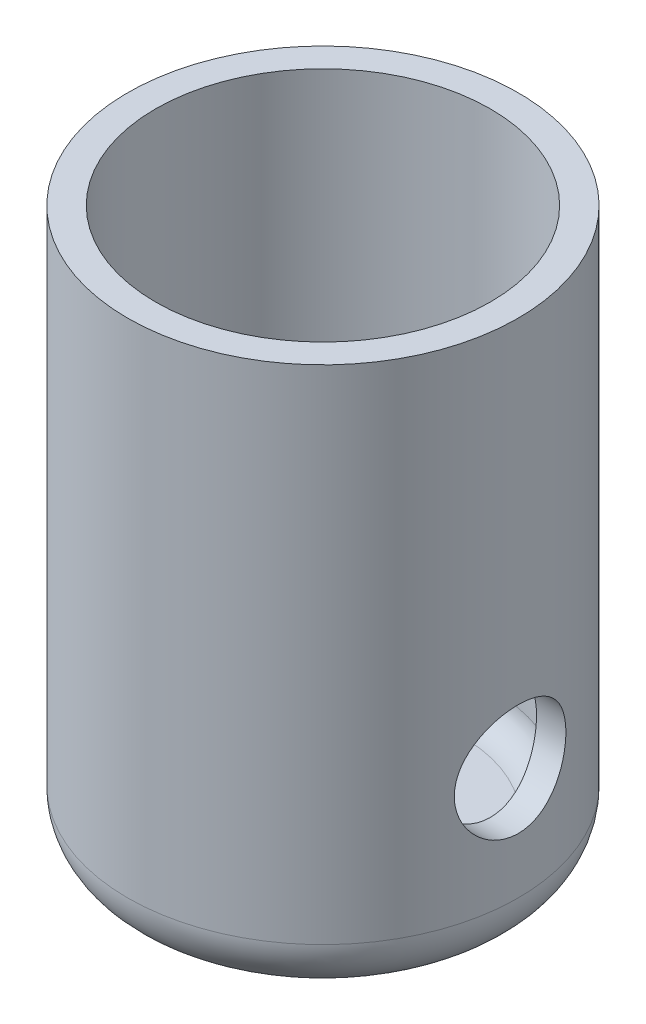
ISO-10303-21;
HEADER;
FILE_DESCRIPTION(('STEP AP214'),'2;1');
FILE_NAME('part.step','',(''),(''),'','','');
FILE_SCHEMA(('AUTOMOTIVE_DESIGN { 1 0 10303 214 1 1 1 1 }'));
ENDSEC;
DATA;
#1=APPLICATION_CONTEXT('core data for automotive mechanical design processes');
#2=APPLICATION_PROTOCOL_DEFINITION('international standard','automotive_design',2000,#1);
#3=PRODUCT_CONTEXT('',#1,'mechanical');
#4=PRODUCT('Part','Part','',(#3));
#5=PRODUCT_RELATED_PRODUCT_CATEGORY('part','',(#4));
#6=PRODUCT_DEFINITION_FORMATION('','',#4);
#7=PRODUCT_DEFINITION_CONTEXT('part definition',#1,'design');
#8=PRODUCT_DEFINITION('design','',#6,#7);
#9=PRODUCT_DEFINITION_SHAPE('','',#8);
#10=(LENGTH_UNIT() NAMED_UNIT(*) SI_UNIT(.MILLI.,.METRE.));
#11=(NAMED_UNIT(*) PLANE_ANGLE_UNIT() SI_UNIT($,.RADIAN.));
#12=(NAMED_UNIT(*) SI_UNIT($,.STERADIAN.) SOLID_ANGLE_UNIT());
#13=UNCERTAINTY_MEASURE_WITH_UNIT(LENGTH_MEASURE(1.E-05),#10,'distance_accuracy_value','');
#14=(GEOMETRIC_REPRESENTATION_CONTEXT(3) GLOBAL_UNCERTAINTY_ASSIGNED_CONTEXT((#13)) GLOBAL_UNIT_ASSIGNED_CONTEXT((#10,
#11,#12)) REPRESENTATION_CONTEXT('',''));
#15=CARTESIAN_POINT('',(0.,0.,0.));
#16=DIRECTION('',(0.,0.,1.));
#17=DIRECTION('',(1.,0.,0.));
#18=AXIS2_PLACEMENT_3D('',#15,#16,#17);
#19=CARTESIAN_POINT('',(3.88902869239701,30.7949839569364,0.));
#20=DIRECTION('',(0.,1.,0.));
#21=DIRECTION('',(0.,0.,1.));
#22=AXIS2_PLACEMENT_3D('',#19,#20,#21);
#23=CYLINDRICAL_SURFACE('',#22,3.5);
#24=CARTESIAN_POINT('',(7.38902869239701,17.2853570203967,0.));
#25=CARTESIAN_POINT('',(7.38902803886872,17.2853560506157,-0.0549774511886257));
#26=CARTESIAN_POINT('',(7.38772077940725,17.2808081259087,-0.109964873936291));
#27=CARTESIAN_POINT('',(7.38263322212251,17.2627748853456,-0.218345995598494));
#28=CARTESIAN_POINT('',(7.37885198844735,17.2492861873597,-0.271739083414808));
#29=CARTESIAN_POINT('',(7.36923214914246,17.2138530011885,-0.375352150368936));
#30=CARTESIAN_POINT('',(7.36339641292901,17.1919203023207,-0.425576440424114));
#31=CARTESIAN_POINT('',(7.35027858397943,17.1402680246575,-0.521634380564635));
#32=CARTESIAN_POINT('',(7.34299633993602,17.1105476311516,-0.567467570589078));
#33=CARTESIAN_POINT('',(7.32755236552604,17.0433395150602,-0.654647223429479));
#34=CARTESIAN_POINT('',(7.31937390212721,17.0056846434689,-0.695861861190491));
#35=CARTESIAN_POINT('',(7.30316236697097,16.924033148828,-0.771485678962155));
#36=CARTESIAN_POINT('',(7.29512931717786,16.8800355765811,-0.805893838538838));
#37=CARTESIAN_POINT('',(7.27994376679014,16.7858602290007,-0.867598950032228));
#38=CARTESIAN_POINT('',(7.27281220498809,16.7355760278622,-0.894739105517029));
#39=CARTESIAN_POINT('',(7.26048541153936,16.6309210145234,-0.940125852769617));
#40=CARTESIAN_POINT('',(7.25528976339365,16.5765510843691,-0.958374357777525));
#41=CARTESIAN_POINT('',(7.24759673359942,16.4667396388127,-0.984992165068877));
#42=CARTESIAN_POINT('',(7.24503358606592,16.4113613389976,-0.993602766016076));
#43=CARTESIAN_POINT('',(7.24269973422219,16.2998914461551,-1.00145333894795));
#44=CARTESIAN_POINT('',(7.24292842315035,16.2438000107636,-1.00069534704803));
#45=CARTESIAN_POINT('',(7.24609386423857,16.1344227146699,-0.990020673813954));
#46=CARTESIAN_POINT('',(7.2489426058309,16.0811048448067,-0.980401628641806));
#47=CARTESIAN_POINT('',(7.25688543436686,15.9768734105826,-0.952756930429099));
#48=CARTESIAN_POINT('',(7.26197972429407,15.9259600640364,-0.934730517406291));
#49=CARTESIAN_POINT('',(7.27391300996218,15.8272338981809,-0.890553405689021));
#50=CARTESIAN_POINT('',(7.28077327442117,15.7794684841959,-0.864302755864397));
#51=CARTESIAN_POINT('',(7.29545477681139,15.68891873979,-0.804491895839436));
#52=CARTESIAN_POINT('',(7.30327622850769,15.6461355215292,-0.770930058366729));
#53=CARTESIAN_POINT('',(7.31935994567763,15.5650708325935,-0.695951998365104));
#54=CARTESIAN_POINT('',(7.32762771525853,15.5270197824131,-0.654287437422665));
#55=CARTESIAN_POINT('',(7.34340992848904,15.4583940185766,-0.565066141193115));
#56=CARTESIAN_POINT('',(7.35092433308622,15.4278196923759,-0.517509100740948));
#57=CARTESIAN_POINT('',(7.36441133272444,15.3748926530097,-0.417461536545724));
#58=CARTESIAN_POINT('',(7.37037506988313,15.3525868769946,-0.364944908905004));
#59=CARTESIAN_POINT('',(7.38002494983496,15.3171900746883,-0.256696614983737));
#60=CARTESIAN_POINT('',(7.38371166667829,15.3040967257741,-0.200965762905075));
#61=CARTESIAN_POINT('',(7.38830306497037,15.287870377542,-0.0898331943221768));
#62=CARTESIAN_POINT('',(7.38929505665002,15.2844246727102,-0.0344806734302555));
#63=CARTESIAN_POINT('',(7.38863911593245,15.2867206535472,0.0760132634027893));
#64=CARTESIAN_POINT('',(7.3869915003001,15.2924612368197,0.131154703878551));
#65=CARTESIAN_POINT('',(7.3812983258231,15.3127122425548,0.238509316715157));
#66=CARTESIAN_POINT('',(7.37730175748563,15.3270436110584,0.290759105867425));
#67=CARTESIAN_POINT('',(7.36736868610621,15.363857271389,0.392104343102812));
#68=CARTESIAN_POINT('',(7.36143195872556,15.3863405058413,0.441199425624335));
#69=CARTESIAN_POINT('',(7.34807849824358,15.4393686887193,0.536020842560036));
#70=CARTESIAN_POINT('',(7.34063250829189,15.4700776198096,0.581651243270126));
#71=CARTESIAN_POINT('',(7.32511842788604,15.538483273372,0.667219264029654));
#72=CARTESIAN_POINT('',(7.31705019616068,15.5761815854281,0.707155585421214));
#73=CARTESIAN_POINT('',(7.30087179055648,15.6589616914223,0.781553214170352));
#74=CARTESIAN_POINT('',(7.29276887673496,15.7042446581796,0.815792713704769));
#75=CARTESIAN_POINT('',(7.27772316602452,15.8000883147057,0.87619765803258));
#76=CARTESIAN_POINT('',(7.27078032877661,15.8506488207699,0.902363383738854));
#77=CARTESIAN_POINT('',(7.25892194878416,15.9554026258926,0.945687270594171));
#78=CARTESIAN_POINT('',(7.25399569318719,16.0095749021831,0.962893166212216));
#79=CARTESIAN_POINT('',(7.24674097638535,16.1202119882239,0.987897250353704));
#80=CARTESIAN_POINT('',(7.24441172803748,16.1766760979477,0.995698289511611));
#81=CARTESIAN_POINT('',(7.24268720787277,16.2880050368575,1.00149012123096));
#82=CARTESIAN_POINT('',(7.24318449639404,16.342849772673,0.999840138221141));
#83=CARTESIAN_POINT('',(7.246801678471,16.4514443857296,0.987623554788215));
#84=CARTESIAN_POINT('',(7.24992148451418,16.5051942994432,0.977057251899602));
#85=CARTESIAN_POINT('',(7.25836357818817,16.6095462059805,0.947529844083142));
#86=CARTESIAN_POINT('',(7.2636630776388,16.6601747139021,0.928655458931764));
#87=CARTESIAN_POINT('',(7.27586520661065,16.7575863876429,0.883114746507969));
#88=CARTESIAN_POINT('',(7.28276811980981,16.8043688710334,0.856447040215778));
#89=CARTESIAN_POINT('',(7.29768703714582,16.8944487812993,0.795032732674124));
#90=CARTESIAN_POINT('',(7.3057325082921,16.9375777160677,0.760046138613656));
#91=CARTESIAN_POINT('',(7.3218779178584,17.0174689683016,0.683429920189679));
#92=CARTESIAN_POINT('',(7.32997786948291,17.0542296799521,0.641798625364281));
#93=CARTESIAN_POINT('',(7.34556849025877,17.12127561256,0.551787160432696));
#94=CARTESIAN_POINT('',(7.35303819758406,17.1513705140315,0.50326125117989));
#95=CARTESIAN_POINT('',(7.36628567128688,17.2029299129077,0.401625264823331));
#96=CARTESIAN_POINT('',(7.37206436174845,17.2243991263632,0.34851771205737));
#97=CARTESIAN_POINT('',(7.38066541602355,17.2557807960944,0.246458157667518));
#98=CARTESIAN_POINT('',(7.38377711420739,17.266843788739,0.197881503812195));
#99=CARTESIAN_POINT('',(7.38795891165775,17.2816318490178,0.0995391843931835));
#100=CARTESIAN_POINT('',(7.38902928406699,17.2853578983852,0.0497736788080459));
#101=CARTESIAN_POINT('',(7.38902869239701,17.2853570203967,0.));
#102=B_SPLINE_CURVE_WITH_KNOTS('',3,(#24,#25,#26,#27,#28,#29,#30,#31,#32,#33,#34,#35,#36,#37,
#38,#39,#40,#41,#42,#43,#44,#45,#46,#47,#48,#49,#50,#51,#52,#53,#54,#55,#56,#57,#58,#59,#60,#61,
#62,#63,#64,#65,#66,#67,#68,#69,#70,#71,#72,#73,#74,#75,#76,#77,#78,#79,#80,#81,#82,#83,#84,#85,
#86,#87,#88,#89,#90,#91,#92,#93,#94,#95,#96,#97,#98,#99,#100,#101),.UNSPECIFIED.,.T.,.F.,(4,2,2,
2,2,2,2,2,2,2,2,2,2,2,2,2,2,2,2,2,2,2,2,2,2,2,2,2,2,2,2,2,2,2,2,2,2,2,4),(0.,0.164749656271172,
0.32956166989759,0.494144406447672,0.65874436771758,0.827239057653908,0.995758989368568,
1.16766537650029,1.33953475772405,1.50699754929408,1.67442394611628,1.83642392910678,
1.99843855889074,2.16250401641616,2.32660602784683,2.49689250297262,2.66718780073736,
2.83843550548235,3.00964002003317,3.17522728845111,3.34079468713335,3.50302570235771,
3.66527548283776,3.83103762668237,3.99683751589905,4.16806052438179,4.33927757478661,
4.50957286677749,4.6798165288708,4.84363340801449,5.00744482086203,5.16958548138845,
5.33175484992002,5.49933828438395,5.66696391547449,5.83888989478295,6.01072174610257,
6.15989734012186,6.30905297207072),.UNSPECIFIED.);
#103=CARTESIAN_POINT('',(7.38902869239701,17.2853570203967,0.));
#104=VERTEX_POINT('',#103);
#105=EDGE_CURVE('E70',#104,#104,#102,.T.);
#106=ORIENTED_EDGE('',*,*,#105,.T.);
#107=EDGE_LOOP('',(#106));
#108=FACE_BOUND('',#107,.T.);
#109=CARTESIAN_POINT('',(3.88902869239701,23.2853570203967,0.));
#110=DIRECTION('',(0.,1.,0.));
#111=DIRECTION('',(0.,0.,1.));
#112=AXIS2_PLACEMENT_3D('',#109,#110,#111);
#113=CIRCLE('',#112,3.5);
#114=CARTESIAN_POINT('',(3.88902869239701,23.2853570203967,3.5));
#115=VERTEX_POINT('',#114);
#116=EDGE_CURVE('E10',#115,#115,#113,.T.);
#117=ORIENTED_EDGE('',*,*,#116,.F.);
#118=EDGE_LOOP('',(#117));
#119=FACE_BOUND('',#118,.T.);
#120=CARTESIAN_POINT('',(3.88902869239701,14.2853570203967,0.));
#121=DIRECTION('',(0.,1.,0.));
#122=DIRECTION('',(0.,0.,1.));
#123=AXIS2_PLACEMENT_3D('',#120,#121,#122);
#124=CIRCLE('',#123,3.5);
#125=CARTESIAN_POINT('',(3.88902869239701,14.2853570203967,3.5));
#126=VERTEX_POINT('',#125);
#127=EDGE_CURVE('E41',#126,#126,#124,.T.);
#128=ORIENTED_EDGE('',*,*,#127,.T.);
#129=EDGE_LOOP('',(#128));
#130=FACE_BOUND('',#129,.T.);
#131=CARTESIAN_POINT('',(0.534926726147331,16.2853570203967,1.));
#132=CARTESIAN_POINT('',(0.534925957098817,16.230431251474,0.999999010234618));
#133=CARTESIAN_POINT('',(0.533562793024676,16.1754954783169,0.995459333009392));
#134=CARTESIAN_POINT('',(0.528276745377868,16.0672214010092,0.977461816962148));
#135=CARTESIAN_POINT('',(0.524352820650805,16.0138837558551,0.964000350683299));
#136=CARTESIAN_POINT('',(0.514425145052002,15.9103884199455,0.928646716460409));
#137=CARTESIAN_POINT('',(0.508424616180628,15.860225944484,0.906767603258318));
#138=CARTESIAN_POINT('',(0.495024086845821,15.7642731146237,0.85524182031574));
#139=CARTESIAN_POINT('',(0.48762392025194,15.7184832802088,0.825594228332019));
#140=CARTESIAN_POINT('',(0.472019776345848,15.6312612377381,0.758462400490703));
#141=CARTESIAN_POINT('',(0.463799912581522,15.5899731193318,0.72079460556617));
#142=CARTESIAN_POINT('',(0.447618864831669,15.5142056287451,0.639085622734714));
#143=CARTESIAN_POINT('',(0.439657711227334,15.4797270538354,0.595043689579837));
#144=CARTESIAN_POINT('',(0.424712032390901,15.4179426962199,0.500823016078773));
#145=CARTESIAN_POINT('',(0.417748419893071,15.3907822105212,0.450545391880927));
#146=CARTESIAN_POINT('',(0.405765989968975,15.3453561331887,0.345904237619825));
#147=CARTESIAN_POINT('',(0.400746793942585,15.3270888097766,0.291541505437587));
#148=CARTESIAN_POINT('',(0.393331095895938,15.3004397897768,0.181779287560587));
#149=CARTESIAN_POINT('',(0.390869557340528,15.2918125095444,0.126443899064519));
#150=CARTESIAN_POINT('',(0.388618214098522,15.2839136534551,0.0150600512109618));
#151=CARTESIAN_POINT('',(0.388827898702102,15.284640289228,-0.0409882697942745));
#152=CARTESIAN_POINT('',(0.391848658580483,15.2952602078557,-0.150490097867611));
#153=CARTESIAN_POINT('',(0.394584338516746,15.3048878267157,-0.203971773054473));
#154=CARTESIAN_POINT('',(0.402259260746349,15.3326045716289,-0.308526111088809));
#155=CARTESIAN_POINT('',(0.407198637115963,15.3506942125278,-0.359598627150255));
#156=CARTESIAN_POINT('',(0.418833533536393,15.3950117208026,-0.458536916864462));
#157=CARTESIAN_POINT('',(0.425547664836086,15.4213264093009,-0.506361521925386));
#158=CARTESIAN_POINT('',(0.440014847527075,15.4812793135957,-0.597003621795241));
#159=CARTESIAN_POINT('',(0.447768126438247,15.5149191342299,-0.639820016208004));
#160=CARTESIAN_POINT('',(0.463800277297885,15.589959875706,-0.720816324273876));
#161=CARTESIAN_POINT('',(0.472088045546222,15.6315917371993,-0.758780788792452));
#162=CARTESIAN_POINT('',(0.488013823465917,15.7207145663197,-0.827246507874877));
#163=CARTESIAN_POINT('',(0.495651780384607,15.7682060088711,-0.857747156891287));
#164=CARTESIAN_POINT('',(0.509452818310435,15.8682224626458,-0.910616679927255));
#165=CARTESIAN_POINT('',(0.515603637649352,15.920784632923,-0.932918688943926));
#166=CARTESIAN_POINT('',(0.525585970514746,16.0291336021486,-0.968294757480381));
#167=CARTESIAN_POINT('',(0.529418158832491,16.0849194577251,-0.981371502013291));
#168=CARTESIAN_POINT('',(0.534183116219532,16.1960972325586,-0.997537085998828));
#169=CARTESIAN_POINT('',(0.535210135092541,16.2514379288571,-1.00095074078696));
#170=CARTESIAN_POINT('',(0.534507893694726,16.3619011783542,-0.998594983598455));
#171=CARTESIAN_POINT('',(0.5327789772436,16.417023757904,-0.992826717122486));
#172=CARTESIAN_POINT('',(0.526851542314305,16.524177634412,-0.97255890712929));
#173=CARTESIAN_POINT('',(0.522710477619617,16.5762508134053,-0.958262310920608));
#174=CARTESIAN_POINT('',(0.512483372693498,16.6772579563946,-0.921575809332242));
#175=CARTESIAN_POINT('',(0.506397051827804,16.7261914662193,-0.899184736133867));
#176=CARTESIAN_POINT('',(0.492777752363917,16.8208680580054,-0.846309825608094));
#177=CARTESIAN_POINT('',(0.485212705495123,16.8665022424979,-0.815639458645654));
#178=CARTESIAN_POINT('',(0.469560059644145,16.9520952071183,-0.747302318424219));
#179=CARTESIAN_POINT('',(0.46147234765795,16.9920527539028,-0.709634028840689));
#180=CARTESIAN_POINT('',(0.445355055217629,17.0665467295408,-0.626854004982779));
#181=CARTESIAN_POINT('',(0.437336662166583,17.1008545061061,-0.581533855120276));
#182=CARTESIAN_POINT('',(0.422538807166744,17.1613798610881,-0.485592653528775));
#183=CARTESIAN_POINT('',(0.415759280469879,17.1875978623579,-0.434971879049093));
#184=CARTESIAN_POINT('',(0.404246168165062,17.2309491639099,-0.330216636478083));
#185=CARTESIAN_POINT('',(0.399497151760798,17.2481512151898,-0.276112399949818));
#186=CARTESIAN_POINT('',(0.392511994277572,17.2731704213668,-0.165622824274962));
#187=CARTESIAN_POINT('',(0.390275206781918,17.2809899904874,-0.10923807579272));
#188=CARTESIAN_POINT('',(0.3886020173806,17.2868527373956,0.00208911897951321));
#189=CARTESIAN_POINT('',(0.389070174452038,17.2852290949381,0.0570128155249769));
#190=CARTESIAN_POINT('',(0.392533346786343,17.2730378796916,0.165772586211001));
#191=CARTESIAN_POINT('',(0.39552824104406,17.2624707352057,0.219608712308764));
#192=CARTESIAN_POINT('',(0.40368468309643,17.2328913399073,0.324202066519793));
#193=CARTESIAN_POINT('',(0.40882662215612,17.2139554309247,0.374982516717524));
#194=CARTESIAN_POINT('',(0.420743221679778,17.168243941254,0.47267360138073));
#195=CARTESIAN_POINT('',(0.427518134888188,17.1414671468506,0.519583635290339));
#196=CARTESIAN_POINT('',(0.44223391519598,17.0799083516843,0.609716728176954));
#197=CARTESIAN_POINT('',(0.450203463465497,17.0449119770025,0.652788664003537));
#198=CARTESIAN_POINT('',(0.46630836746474,16.9683024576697,0.732560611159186));
#199=CARTESIAN_POINT('',(0.474443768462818,16.9266874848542,0.769258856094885));
#200=CARTESIAN_POINT('',(0.490208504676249,16.836708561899,0.836204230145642));
#201=CARTESIAN_POINT('',(0.497818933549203,16.7881960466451,0.866256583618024));
#202=CARTESIAN_POINT('',(0.511386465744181,16.6865960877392,0.917739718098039));
#203=CARTESIAN_POINT('',(0.517344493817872,16.6335112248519,0.939175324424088));
#204=CARTESIAN_POINT('',(0.526236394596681,16.531530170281,0.97049267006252));
#205=CARTESIAN_POINT('',(0.529466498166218,16.4830118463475,0.981529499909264));
#206=CARTESIAN_POINT('',(0.533811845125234,16.3847839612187,0.996283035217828));
#207=CARTESIAN_POINT('',(0.534927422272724,16.3350745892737,1.00000089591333));
#208=CARTESIAN_POINT('',(0.534926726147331,16.2853570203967,1.));
#209=B_SPLINE_CURVE_WITH_KNOTS('',3,(#131,#132,#133,#134,#135,#136,#137,#138,#139,#140,#141,
#142,#143,#144,#145,#146,#147,#148,#149,#150,#151,#152,#153,#154,#155,#156,#157,#158,#159,#160,
#161,#162,#163,#164,#165,#166,#167,#168,#169,#170,#171,#172,#173,#174,#175,#176,#177,#178,#179,
#180,#181,#182,#183,#184,#185,#186,#187,#188,#189,#190,#191,#192,#193,#194,#195,#196,#197,#198,
#199,#200,#201,#202,#203,#204,#205,#206,#207,#208),.UNSPECIFIED.,.T.,.F.,(4,2,2,2,2,2,2,2,2,2,2,
2,2,2,2,2,2,2,2,2,2,2,2,2,2,2,2,2,2,2,2,2,2,2,2,2,2,2,4),(0.,0.164594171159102,0.32925530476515,
0.493662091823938,0.658088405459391,0.826785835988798,0.995503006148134,1.16735741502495,
1.33917834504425,1.50651450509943,1.67381867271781,1.83628518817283,1.99876158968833,
2.16301451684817,2.32730346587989,2.49735806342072,2.66742645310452,2.83885260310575,
3.01022883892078,3.17577181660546,3.34129414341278,3.5030264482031,3.66478209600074,
3.83054003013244,3.99633392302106,4.16772694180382,4.33911100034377,4.50916842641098,
4.67918208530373,4.84323448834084,5.00727903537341,5.16985706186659,5.33246026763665,
5.4998988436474,5.66738374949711,5.83926806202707,6.01105598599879,6.16006644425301,
6.30905338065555),.UNSPECIFIED.);
#210=CARTESIAN_POINT('',(0.534926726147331,16.2853570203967,1.));
#211=VERTEX_POINT('',#210);
#212=EDGE_CURVE('E66',#211,#211,#209,.T.);
#213=ORIENTED_EDGE('',*,*,#212,.T.);
#214=EDGE_LOOP('',(#213));
#215=FACE_BOUND('',#214,.T.);
#216=ADVANCED_FACE('F29',(#108,#119,#130,#215),#23,.T.);
#217=CARTESIAN_POINT('',(3.88902869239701,30.7949839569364,0.));
#218=DIRECTION('',(0.,1.,0.));
#219=DIRECTION('',(0.,0.,1.));
#220=AXIS2_PLACEMENT_3D('',#217,#218,#219);
#221=CYLINDRICAL_SURFACE('',#220,3.);
#222=CARTESIAN_POINT('',(1.06060156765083,16.2853570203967,1.));
#223=CARTESIAN_POINT('',(1.06060174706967,16.230888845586,1.0000002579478));
#224=CARTESIAN_POINT('',(1.05901099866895,16.1764222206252,0.995534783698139));
#225=CARTESIAN_POINT('',(1.05285295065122,16.0691025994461,0.977851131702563));
#226=CARTESIAN_POINT('',(1.04828516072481,16.0162498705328,0.964631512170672));
#227=CARTESIAN_POINT('',(1.03674665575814,15.9137301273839,0.929955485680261));
#228=CARTESIAN_POINT('',(1.02978065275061,15.8640570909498,0.908515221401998));
#229=CARTESIAN_POINT('',(1.01423747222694,15.7689969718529,0.858061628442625));
#230=CARTESIAN_POINT('',(1.0056599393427,15.7236108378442,0.829046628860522));
#231=CARTESIAN_POINT('',(0.987483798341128,15.6366370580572,0.763051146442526));
#232=CARTESIAN_POINT('',(0.97785974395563,15.5952415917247,0.725824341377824));
#233=CARTESIAN_POINT('',(0.958890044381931,15.5191502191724,0.644987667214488));
#234=CARTESIAN_POINT('',(0.949544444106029,15.4844553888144,0.6013767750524));
#235=CARTESIAN_POINT('',(0.931890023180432,15.421878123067,0.507604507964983));
#236=CARTESIAN_POINT('',(0.923614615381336,15.3941970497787,0.457301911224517));
#237=CARTESIAN_POINT('',(0.909332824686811,15.3477654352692,0.352431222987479));
#238=CARTESIAN_POINT('',(0.903325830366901,15.3290124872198,0.297864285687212));
#239=CARTESIAN_POINT('',(0.894437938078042,15.3016211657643,0.18802881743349));
#240=CARTESIAN_POINT('',(0.891455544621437,15.2926535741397,0.132850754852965));
#241=CARTESIAN_POINT('',(0.888592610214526,15.2840407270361,0.0216978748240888));
#242=CARTESIAN_POINT('',(0.888711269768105,15.2843930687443,-0.034276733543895));
#243=CARTESIAN_POINT('',(0.89196829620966,15.2942012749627,-0.143103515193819));
#244=CARTESIAN_POINT('',(0.894988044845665,15.3032995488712,-0.195992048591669));
#245=CARTESIAN_POINT('',(0.903559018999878,15.3297500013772,-0.299443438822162));
#246=CARTESIAN_POINT('',(0.909110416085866,15.3471027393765,-0.350006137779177));
#247=CARTESIAN_POINT('',(0.922271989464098,15.3897783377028,-0.448152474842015));
#248=CARTESIAN_POINT('',(0.929908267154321,15.4152029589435,-0.495688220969));
#249=CARTESIAN_POINT('',(0.946444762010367,15.4732167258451,-0.585924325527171));
#250=CARTESIAN_POINT('',(0.955345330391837,15.5058078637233,-0.628623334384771));
#251=CARTESIAN_POINT('',(0.973966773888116,15.5790314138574,-0.710100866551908));
#252=CARTESIAN_POINT('',(0.98370654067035,15.6199701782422,-0.748600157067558));
#253=CARTESIAN_POINT('',(1.00255533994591,15.7078057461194,-0.818277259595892));
#254=CARTESIAN_POINT('',(1.01166427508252,15.7547034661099,-0.849453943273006));
#255=CARTESIAN_POINT('',(1.02832344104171,15.8540106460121,-0.903987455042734));
#256=CARTESIAN_POINT('',(1.0358495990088,15.9064891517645,-0.927226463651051));
#257=CARTESIAN_POINT('',(1.04821218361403,16.014928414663,-0.964443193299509));
#258=CARTESIAN_POINT('',(1.05304973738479,16.0708877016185,-0.978424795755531));
#259=CARTESIAN_POINT('',(1.05923232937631,16.1819953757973,-0.996161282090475));
#260=CARTESIAN_POINT('',(1.06072508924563,16.2370664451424,-1.00034909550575));
#261=CARTESIAN_POINT('',(1.06046197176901,16.3471331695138,-0.999605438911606));
#262=CARTESIAN_POINT('',(1.05870668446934,16.4021288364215,-0.994675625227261));
#263=CARTESIAN_POINT('',(1.05229251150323,16.5085139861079,-0.976225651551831));
#264=CARTESIAN_POINT('',(1.04773543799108,16.5599624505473,-0.963006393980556));
#265=CARTESIAN_POINT('',(1.03634315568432,16.6599006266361,-0.928713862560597));
#266=CARTESIAN_POINT('',(1.02950754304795,16.7083898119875,-0.907639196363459));
#267=CARTESIAN_POINT('',(1.01405991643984,16.8027374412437,-0.857474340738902));
#268=CARTESIAN_POINT('',(1.00539843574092,16.8484636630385,-0.828151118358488));
#269=CARTESIAN_POINT('',(0.987371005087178,16.9345030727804,-0.762585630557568));
#270=CARTESIAN_POINT('',(0.978004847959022,16.9748146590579,-0.726341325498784));
#271=CARTESIAN_POINT('',(0.959078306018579,17.0508850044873,-0.645891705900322));
#272=CARTESIAN_POINT('',(0.949530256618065,17.0863314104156,-0.601387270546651));
#273=CARTESIAN_POINT('',(0.931760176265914,17.1492731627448,-0.506827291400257));
#274=CARTESIAN_POINT('',(0.923538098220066,17.1767687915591,-0.456771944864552));
#275=CARTESIAN_POINT('',(0.90938463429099,17.2227771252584,-0.352779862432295));
#276=CARTESIAN_POINT('',(0.903438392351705,17.2413482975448,-0.298871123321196));
#277=CARTESIAN_POINT('',(0.894442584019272,17.2690847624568,-0.188458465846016));
#278=CARTESIAN_POINT('',(0.891391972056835,17.2782534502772,-0.131955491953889));
#279=CARTESIAN_POINT('',(0.888610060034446,17.2866190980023,-0.0208153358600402));
#280=CARTESIAN_POINT('',(0.888729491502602,17.2862644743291,0.0337847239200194));
#281=CARTESIAN_POINT('',(0.89190672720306,17.2766997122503,0.142111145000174));
#282=CARTESIAN_POINT('',(0.894964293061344,17.2674902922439,0.195837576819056));
#283=CARTESIAN_POINT('',(0.903619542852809,17.2407747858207,0.300042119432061));
#284=CARTESIAN_POINT('',(0.909176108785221,17.2234028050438,0.350558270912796));
#285=CARTESIAN_POINT('',(0.922257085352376,17.1809794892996,0.44797835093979));
#286=CARTESIAN_POINT('',(0.929781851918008,17.1559267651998,0.49488162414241));
#287=CARTESIAN_POINT('',(0.946370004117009,17.0977875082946,0.585634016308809));
#288=CARTESIAN_POINT('',(0.955479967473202,17.0644383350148,0.629306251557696));
#289=CARTESIAN_POINT('',(0.97409880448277,16.9910996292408,0.710581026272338));
#290=CARTESIAN_POINT('',(0.983607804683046,16.951107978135,0.748181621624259));
#291=CARTESIAN_POINT('',(1.00239589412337,16.8637476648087,0.817741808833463));
#292=CARTESIAN_POINT('',(1.01165141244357,16.8161515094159,0.849422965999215));
#293=CARTESIAN_POINT('',(1.02842675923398,16.7160225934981,0.904314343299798));
#294=CARTESIAN_POINT('',(1.03594704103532,16.6634911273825,0.927526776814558));
#295=CARTESIAN_POINT('',(1.04801535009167,16.5573951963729,0.963843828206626));
#296=CARTESIAN_POINT('',(1.05268236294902,16.503984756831,0.977357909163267));
#297=CARTESIAN_POINT('',(1.05897485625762,16.3955009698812,0.995434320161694));
#298=CARTESIAN_POINT('',(1.06060138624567,16.340428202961,0.999999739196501));
#299=CARTESIAN_POINT('',(1.06060156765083,16.2853570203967,1.));
#300=B_SPLINE_CURVE_WITH_KNOTS('',3,(#222,#223,#224,#225,#226,#227,#228,#229,#230,#231,#232,
#233,#234,#235,#236,#237,#238,#239,#240,#241,#242,#243,#244,#245,#246,#247,#248,#249,#250,#251,
#252,#253,#254,#255,#256,#257,#258,#259,#260,#261,#262,#263,#264,#265,#266,#267,#268,#269,#270,
#271,#272,#273,#274,#275,#276,#277,#278,#279,#280,#281,#282,#283,#284,#285,#286,#287,#288,#289,
#290,#291,#292,#293,#294,#295,#296,#297,#298,#299),.UNSPECIFIED.,.T.,.F.,(4,2,2,2,2,2,2,2,2,2,2,
2,2,2,2,2,2,2,2,2,2,2,2,2,2,2,2,2,2,2,2,2,2,2,2,2,2,2,4),(0.,0.163200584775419,
0.326428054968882,0.489336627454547,0.65228116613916,0.821013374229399,0.989772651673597,
1.16293506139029,1.33605076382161,1.50314318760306,1.67019253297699,1.83069004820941,
1.99119844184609,2.15381654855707,2.31647991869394,2.48680174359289,2.65714979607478,
2.82992639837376,3.00263051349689,3.16754291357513,3.33242535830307,3.49164395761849,
3.65089079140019,3.81518857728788,3.97953485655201,4.15178808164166,4.32403518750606,
4.49513791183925,4.6661788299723,4.82918084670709,4.99216964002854,5.15256956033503,
5.31299850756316,5.47935519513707,5.64576504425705,5.81868902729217,5.9915677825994,
6.15663212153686,6.3216394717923),.UNSPECIFIED.);
#301=CARTESIAN_POINT('',(1.06060156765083,16.2853570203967,1.));
#302=VERTEX_POINT('',#301);
#303=EDGE_CURVE('E49',#302,#302,#300,.T.);
#304=ORIENTED_EDGE('',*,*,#303,.F.);
#305=EDGE_LOOP('',(#304));
#306=FACE_BOUND('',#305,.T.);
#307=CARTESIAN_POINT('',(3.88902869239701,14.2853570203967,0.));
#308=DIRECTION('',(0.,1.,0.));
#309=DIRECTION('',(0.,0.,1.));
#310=AXIS2_PLACEMENT_3D('',#307,#308,#309);
#311=CIRCLE('',#310,3.);
#312=CARTESIAN_POINT('',(3.88902869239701,14.2853570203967,3.));
#313=VERTEX_POINT('',#312);
#314=EDGE_CURVE('E101',#313,#313,#311,.T.);
#315=ORIENTED_EDGE('',*,*,#314,.F.);
#316=EDGE_LOOP('',(#315));
#317=FACE_BOUND('',#316,.T.);
#318=CARTESIAN_POINT('',(3.88902869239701,23.2853570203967,0.));
#319=DIRECTION('',(0.,1.,0.));
#320=DIRECTION('',(0.,0.,1.));
#321=AXIS2_PLACEMENT_3D('',#318,#319,#320);
#322=CIRCLE('',#321,3.);
#323=CARTESIAN_POINT('',(3.88902869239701,23.2853570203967,3.));
#324=VERTEX_POINT('',#323);
#325=EDGE_CURVE('E103',#324,#324,#322,.T.);
#326=ORIENTED_EDGE('',*,*,#325,.T.);
#327=EDGE_LOOP('',(#326));
#328=FACE_BOUND('',#327,.T.);
#329=CARTESIAN_POINT('',(6.7174558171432,16.2853570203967,1.));
#330=CARTESIAN_POINT('',(6.71745563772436,16.3398251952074,1.0000002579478));
#331=CARTESIAN_POINT('',(6.71904638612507,16.3942918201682,0.995534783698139));
#332=CARTESIAN_POINT('',(6.72520443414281,16.5016114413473,0.977851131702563));
#333=CARTESIAN_POINT('',(6.72977222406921,16.5544641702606,0.964631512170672));
#334=CARTESIAN_POINT('',(6.74131072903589,16.6569839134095,0.929955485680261));
#335=CARTESIAN_POINT('',(6.74827673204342,16.7066569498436,0.908515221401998));
#336=CARTESIAN_POINT('',(6.76381991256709,16.8017170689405,0.858061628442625));
#337=CARTESIAN_POINT('',(6.77239744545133,16.8471032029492,0.829046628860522));
#338=CARTESIAN_POINT('',(6.7905735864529,16.9340769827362,0.763051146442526));
#339=CARTESIAN_POINT('',(6.8001976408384,16.9754724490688,0.725824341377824));
#340=CARTESIAN_POINT('',(6.8191673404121,17.051563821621,0.644987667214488));
#341=CARTESIAN_POINT('',(6.828512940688,17.086258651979,0.6013767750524));
#342=CARTESIAN_POINT('',(6.8461673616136,17.1488359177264,0.507604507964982));
#343=CARTESIAN_POINT('',(6.85444276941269,17.1765169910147,0.457301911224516));
#344=CARTESIAN_POINT('',(6.86872456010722,17.2229486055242,0.352431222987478));
#345=CARTESIAN_POINT('',(6.87473155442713,17.2417015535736,0.297864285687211));
#346=CARTESIAN_POINT('',(6.88361944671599,17.2690928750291,0.18802881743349));
#347=CARTESIAN_POINT('',(6.88660184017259,17.2780604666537,0.132850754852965));
#348=CARTESIAN_POINT('',(6.8894647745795,17.2866733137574,0.0216978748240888));
#349=CARTESIAN_POINT('',(6.88934611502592,17.2863209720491,-0.0342767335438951));
#350=CARTESIAN_POINT('',(6.88608908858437,17.2765127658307,-0.14310351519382));
#351=CARTESIAN_POINT('',(6.88306933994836,17.2674144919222,-0.195992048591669));
#352=CARTESIAN_POINT('',(6.87449836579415,17.2409640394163,-0.299443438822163));
#353=CARTESIAN_POINT('',(6.86894696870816,17.223611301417,-0.350006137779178));
#354=CARTESIAN_POINT('',(6.85578539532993,17.1809357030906,-0.448152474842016));
#355=CARTESIAN_POINT('',(6.84814911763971,17.1555110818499,-0.495688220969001));
#356=CARTESIAN_POINT('',(6.83161262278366,17.0974973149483,-0.585924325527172));
#357=CARTESIAN_POINT('',(6.82271205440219,17.0649061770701,-0.628623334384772));
#358=CARTESIAN_POINT('',(6.80409061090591,16.991682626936,-0.710100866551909));
#359=CARTESIAN_POINT('',(6.79435084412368,16.9507438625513,-0.748600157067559));
#360=CARTESIAN_POINT('',(6.77550204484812,16.862908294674,-0.818277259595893));
#361=CARTESIAN_POINT('',(6.76639310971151,16.8160105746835,-0.849453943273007));
#362=CARTESIAN_POINT('',(6.74973394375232,16.7167033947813,-0.903987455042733));
#363=CARTESIAN_POINT('',(6.74220778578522,16.6642248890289,-0.92722646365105));
#364=CARTESIAN_POINT('',(6.72984520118,16.5557856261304,-0.964443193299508));
#365=CARTESIAN_POINT('',(6.72500764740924,16.4998263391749,-0.978424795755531));
#366=CARTESIAN_POINT('',(6.71882505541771,16.3887186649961,-0.996161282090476));
#367=CARTESIAN_POINT('',(6.7173322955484,16.333647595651,-1.00034909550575));
#368=CARTESIAN_POINT('',(6.71759541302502,16.2235808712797,-0.999605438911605));
#369=CARTESIAN_POINT('',(6.71935070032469,16.1685852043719,-0.994675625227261));
#370=CARTESIAN_POINT('',(6.7257648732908,16.0622000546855,-0.976225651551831));
#371=CARTESIAN_POINT('',(6.73032194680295,16.0107515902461,-0.963006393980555));
#372=CARTESIAN_POINT('',(6.74171422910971,15.9108134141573,-0.928713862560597));
#373=CARTESIAN_POINT('',(6.74854984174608,15.8623242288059,-0.907639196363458));
#374=CARTESIAN_POINT('',(6.76399746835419,15.7679765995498,-0.857474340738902));
#375=CARTESIAN_POINT('',(6.77265894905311,15.7222503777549,-0.828151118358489));
#376=CARTESIAN_POINT('',(6.79068637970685,15.636210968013,-0.762585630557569));
#377=CARTESIAN_POINT('',(6.800052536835,15.5958993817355,-0.726341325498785));
#378=CARTESIAN_POINT('',(6.81897907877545,15.5198290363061,-0.645891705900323));
#379=CARTESIAN_POINT('',(6.82852712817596,15.4843826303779,-0.601387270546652));
#380=CARTESIAN_POINT('',(6.84629720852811,15.4214408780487,-0.506827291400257));
#381=CARTESIAN_POINT('',(6.85451928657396,15.3939452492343,-0.456771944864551));
#382=CARTESIAN_POINT('',(6.86867275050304,15.347936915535,-0.352779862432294));
#383=CARTESIAN_POINT('',(6.87461899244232,15.3293657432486,-0.298871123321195));
#384=CARTESIAN_POINT('',(6.88361480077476,15.3016292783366,-0.188458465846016));
#385=CARTESIAN_POINT('',(6.88666541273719,15.2924605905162,-0.131955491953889));
#386=CARTESIAN_POINT('',(6.88944732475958,15.2840949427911,-0.0208153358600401));
#387=CARTESIAN_POINT('',(6.88932789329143,15.2844495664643,0.0337847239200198));
#388=CARTESIAN_POINT('',(6.88615065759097,15.2940143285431,0.142111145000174));
#389=CARTESIAN_POINT('',(6.88309309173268,15.3032237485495,0.195837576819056));
#390=CARTESIAN_POINT('',(6.87443784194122,15.3299392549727,0.300042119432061));
#391=CARTESIAN_POINT('',(6.86888127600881,15.3473112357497,0.350558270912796));
#392=CARTESIAN_POINT('',(6.85580029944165,15.3897345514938,0.44797835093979));
#393=CARTESIAN_POINT('',(6.84827553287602,15.4147872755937,0.494881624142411));
#394=CARTESIAN_POINT('',(6.83168738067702,15.4729265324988,0.58563401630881));
#395=CARTESIAN_POINT('',(6.82257741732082,15.5062757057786,0.629306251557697));
#396=CARTESIAN_POINT('',(6.80395858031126,15.5796144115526,0.710581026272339));
#397=CARTESIAN_POINT('',(6.79444958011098,15.6196060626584,0.74818162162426));
#398=CARTESIAN_POINT('',(6.77566149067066,15.7069663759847,0.817741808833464));
#399=CARTESIAN_POINT('',(6.76640597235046,15.7545625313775,0.849422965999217));
#400=CARTESIAN_POINT('',(6.74963062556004,15.8546914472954,0.904314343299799));
#401=CARTESIAN_POINT('',(6.74211034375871,15.907222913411,0.927526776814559));
#402=CARTESIAN_POINT('',(6.73004203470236,16.0133188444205,0.963843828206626));
#403=CARTESIAN_POINT('',(6.72537502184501,16.0667292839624,0.977357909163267));
#404=CARTESIAN_POINT('',(6.71908252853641,16.1752130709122,0.995434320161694));
#405=CARTESIAN_POINT('',(6.71745599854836,16.2302858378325,0.999999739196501));
#406=CARTESIAN_POINT('',(6.7174558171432,16.2853570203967,1.));
#407=B_SPLINE_CURVE_WITH_KNOTS('',3,(#329,#330,#331,#332,#333,#334,#335,#336,#337,#338,#339,
#340,#341,#342,#343,#344,#345,#346,#347,#348,#349,#350,#351,#352,#353,#354,#355,#356,#357,#358,
#359,#360,#361,#362,#363,#364,#365,#366,#367,#368,#369,#370,#371,#372,#373,#374,#375,#376,#377,
#378,#379,#380,#381,#382,#383,#384,#385,#386,#387,#388,#389,#390,#391,#392,#393,#394,#395,#396,
#397,#398,#399,#400,#401,#402,#403,#404,#405,#406),.UNSPECIFIED.,.T.,.F.,(4,2,2,2,2,2,2,2,2,2,2,
2,2,2,2,2,2,2,2,2,2,2,2,2,2,2,2,2,2,2,2,2,2,2,2,2,2,2,4),(0.,0.163200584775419,
0.326428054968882,0.489336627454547,0.65228116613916,0.8210133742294,0.989772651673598,
1.16293506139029,1.33605076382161,1.50314318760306,1.67019253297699,1.83069004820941,
1.99119844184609,2.15381654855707,2.31647991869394,2.4868017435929,2.65714979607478,
2.82992639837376,3.00263051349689,3.16754291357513,3.33242535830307,3.49164395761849,
3.65089079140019,3.81518857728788,3.979534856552,4.15178808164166,4.32403518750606,
4.49513791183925,4.6661788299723,4.82918084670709,4.99216964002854,5.15256956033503,
5.31299850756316,5.47935519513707,5.64576504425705,5.81868902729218,5.9915677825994,
6.15663212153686,6.3216394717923),.UNSPECIFIED.);
#408=CARTESIAN_POINT('',(6.7174558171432,16.2853570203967,1.));
#409=VERTEX_POINT('',#408);
#410=EDGE_CURVE('E33',#409,#409,#407,.T.);
#411=ORIENTED_EDGE('',*,*,#410,.F.);
#412=EDGE_LOOP('',(#411));
#413=FACE_BOUND('',#412,.T.);
#414=ADVANCED_FACE('F53',(#306,#317,#328,#413),#221,.F.);
#415=CARTESIAN_POINT('',(0.389028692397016,23.2853570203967,0.));
#416=DIRECTION('',(0.,1.,0.));
#417=DIRECTION('',(0.,0.,1.));
#418=AXIS2_PLACEMENT_3D('',#415,#416,#417);
#419=PLANE('',#418);
#420=ORIENTED_EDGE('',*,*,#325,.F.);
#421=EDGE_LOOP('',(#420));
#422=FACE_BOUND('',#421,.T.);
#423=ORIENTED_EDGE('',*,*,#116,.T.);
#424=EDGE_LOOP('',(#423));
#425=FACE_BOUND('',#424,.T.);
#426=ADVANCED_FACE('F31',(#422,#425),#419,.T.);
#427=CARTESIAN_POINT('',(3.88902869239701,14.2853570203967,0.));
#428=DIRECTION('',(0.,1.,0.));
#429=DIRECTION('',(0.,0.,1.));
#430=AXIS2_PLACEMENT_3D('',#427,#428,#429);
#431=TOROIDAL_SURFACE('',#430,2.5,1.);
#432=CARTESIAN_POINT('',(3.88902869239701,13.2853570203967,0.));
#433=DIRECTION('',(0.,1.,0.));
#434=DIRECTION('',(0.,0.,1.));
#435=AXIS2_PLACEMENT_3D('',#432,#433,#434);
#436=CIRCLE('',#435,2.49999999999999);
#437=CARTESIAN_POINT('',(3.88902869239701,13.2853570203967,2.49999999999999));
#438=VERTEX_POINT('',#437);
#439=EDGE_CURVE('E46',#438,#438,#436,.T.);
#440=ORIENTED_EDGE('',*,*,#439,.T.);
#441=EDGE_LOOP('',(#440));
#442=FACE_BOUND('',#441,.T.);
#443=ORIENTED_EDGE('',*,*,#127,.F.);
#444=EDGE_LOOP('',(#443));
#445=FACE_BOUND('',#444,.T.);
#446=ADVANCED_FACE('F78',(#442,#445),#431,.T.);
#447=CARTESIAN_POINT('',(1.38902869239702,13.2853570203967,0.));
#448=DIRECTION('',(0.,-1.,0.));
#449=DIRECTION('',(0.,0.,-1.));
#450=AXIS2_PLACEMENT_3D('',#447,#448,#449);
#451=PLANE('',#450);
#452=ORIENTED_EDGE('',*,*,#439,.F.);
#453=EDGE_LOOP('',(#452));
#454=FACE_BOUND('',#453,.T.);
#455=ADVANCED_FACE('F82',(#454),#451,.T.);
#456=CARTESIAN_POINT('',(3.88902869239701,14.2853570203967,0.));
#457=DIRECTION('',(0.,1.,0.));
#458=DIRECTION('',(0.,0.,1.));
#459=AXIS2_PLACEMENT_3D('',#456,#457,#458);
#460=TOROIDAL_SURFACE('',#459,2.5,0.5);
#461=CARTESIAN_POINT('',(3.88902869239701,13.7853570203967,0.));
#462=DIRECTION('',(0.,1.,0.));
#463=DIRECTION('',(0.,0.,1.));
#464=AXIS2_PLACEMENT_3D('',#461,#462,#463);
#465=CIRCLE('',#464,2.49999999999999);
#466=CARTESIAN_POINT('',(3.88902869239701,13.7853570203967,2.49999999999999));
#467=VERTEX_POINT('',#466);
#468=EDGE_CURVE('E98',#467,#467,#465,.T.);
#469=ORIENTED_EDGE('',*,*,#468,.F.);
#470=EDGE_LOOP('',(#469));
#471=FACE_BOUND('',#470,.T.);
#472=ORIENTED_EDGE('',*,*,#314,.T.);
#473=EDGE_LOOP('',(#472));
#474=FACE_BOUND('',#473,.T.);
#475=ADVANCED_FACE('F86',(#471,#474),#460,.F.);
#476=CARTESIAN_POINT('',(1.38902869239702,13.7853570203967,0.));
#477=DIRECTION('',(0.,-1.,0.));
#478=DIRECTION('',(0.,0.,-1.));
#479=AXIS2_PLACEMENT_3D('',#476,#477,#478);
#480=PLANE('',#479);
#481=ORIENTED_EDGE('',*,*,#468,.T.);
#482=EDGE_LOOP('',(#481));
#483=FACE_BOUND('',#482,.T.);
#484=ADVANCED_FACE('F88',(#483),#480,.F.);
#485=CARTESIAN_POINT('',(0.389028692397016,16.2853570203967,0.));
#486=DIRECTION('',(-1.,0.,0.));
#487=DIRECTION('',(0.,0.,1.));
#488=AXIS2_PLACEMENT_3D('',#485,#486,#487);
#489=CYLINDRICAL_SURFACE('',#488,1.);
#490=ORIENTED_EDGE('',*,*,#212,.F.);
#491=EDGE_LOOP('',(#490));
#492=FACE_BOUND('',#491,.T.);
#493=ORIENTED_EDGE('',*,*,#303,.T.);
#494=EDGE_LOOP('',(#493));
#495=FACE_BOUND('',#494,.T.);
#496=ADVANCED_FACE('F59',(#492,#495),#489,.F.);
#497=ORIENTED_EDGE('',*,*,#105,.F.);
#498=EDGE_LOOP('',(#497));
#499=FACE_BOUND('',#498,.T.);
#500=ORIENTED_EDGE('',*,*,#410,.T.);
#501=EDGE_LOOP('',(#500));
#502=FACE_BOUND('',#501,.T.);
#503=ADVANCED_FACE('F56',(#499,#502),#489,.F.);
#504=CLOSED_SHELL('',(#216,#414,#426,#446,#455,#475,#484,#496,#503));
#505=MANIFOLD_SOLID_BREP('B2',#504);
#506=ADVANCED_BREP_SHAPE_REPRESENTATION('',(#18,#505),#14);
#507=SHAPE_DEFINITION_REPRESENTATION(#9,#506);
ENDSEC;
END-ISO-10303-21;
